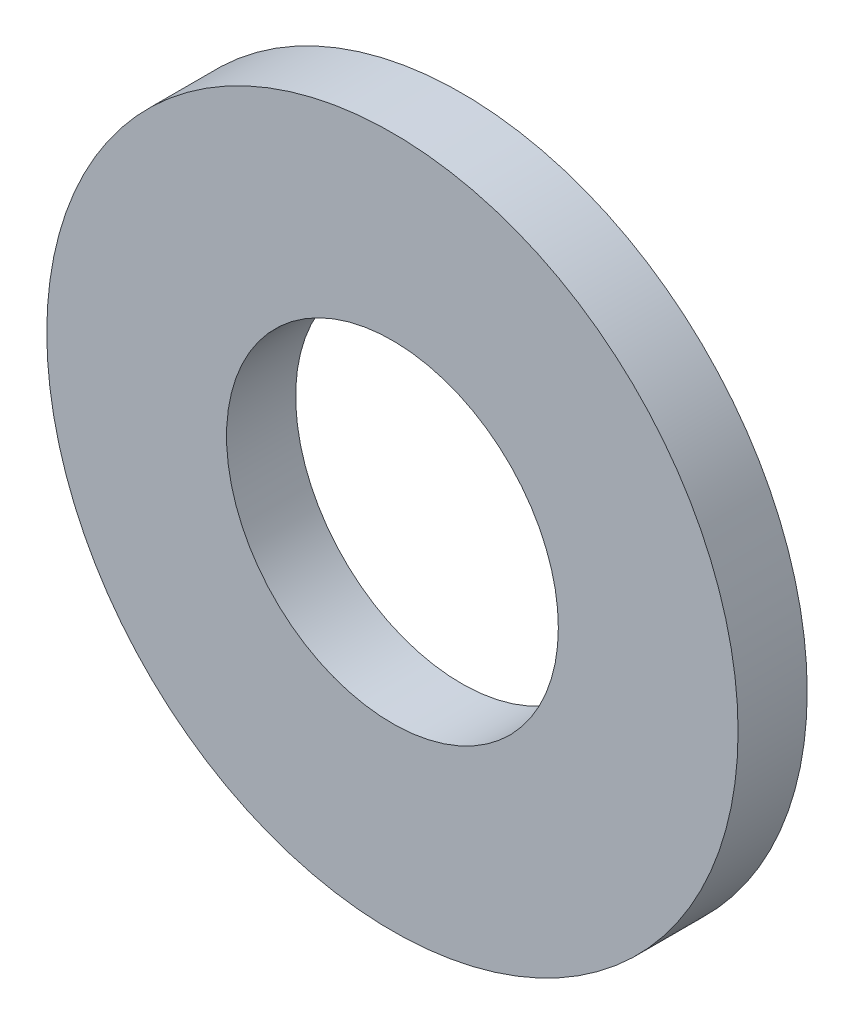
ISO-10303-21;
HEADER;
FILE_DESCRIPTION(('STEP AP214'),'2;1');
FILE_NAME('part.step','',(''),(''),'','','');
FILE_SCHEMA(('AUTOMOTIVE_DESIGN { 1 0 10303 214 1 1 1 1 }'));
ENDSEC;
DATA;
#1=APPLICATION_CONTEXT('core data for automotive mechanical design processes');
#2=APPLICATION_PROTOCOL_DEFINITION('international standard','automotive_design',2000,#1);
#3=PRODUCT_CONTEXT('',#1,'mechanical');
#4=PRODUCT('Part','Part','',(#3));
#5=PRODUCT_RELATED_PRODUCT_CATEGORY('part','',(#4));
#6=PRODUCT_DEFINITION_FORMATION('','',#4);
#7=PRODUCT_DEFINITION_CONTEXT('part definition',#1,'design');
#8=PRODUCT_DEFINITION('design','',#6,#7);
#9=PRODUCT_DEFINITION_SHAPE('','',#8);
#10=(LENGTH_UNIT() NAMED_UNIT(*) SI_UNIT(.MILLI.,.METRE.));
#11=(NAMED_UNIT(*) PLANE_ANGLE_UNIT() SI_UNIT($,.RADIAN.));
#12=(NAMED_UNIT(*) SI_UNIT($,.STERADIAN.) SOLID_ANGLE_UNIT());
#13=UNCERTAINTY_MEASURE_WITH_UNIT(LENGTH_MEASURE(1.E-05),#10,'distance_accuracy_value','');
#14=(GEOMETRIC_REPRESENTATION_CONTEXT(3) GLOBAL_UNCERTAINTY_ASSIGNED_CONTEXT((#13)) GLOBAL_UNIT_ASSIGNED_CONTEXT((#10,
#11,#12)) REPRESENTATION_CONTEXT('',''));
#15=CARTESIAN_POINT('',(0.,0.,0.));
#16=DIRECTION('',(0.,0.,1.));
#17=DIRECTION('',(1.,0.,0.));
#18=AXIS2_PLACEMENT_3D('',#15,#16,#17);
#19=CARTESIAN_POINT('',(0.,0.,2.5));
#20=DIRECTION('',(0.,0.,1.));
#21=DIRECTION('',(1.,0.,0.));
#22=AXIS2_PLACEMENT_3D('',#19,#20,#21);
#23=PLANE('',#22);
#24=CARTESIAN_POINT('',(0.,0.,2.5));
#25=DIRECTION('',(0.,0.,1.));
#26=DIRECTION('',(1.,0.,0.));
#27=AXIS2_PLACEMENT_3D('',#24,#25,#26);
#28=CIRCLE('',#27,12.5);
#29=CARTESIAN_POINT('',(12.5,0.,2.5));
#30=VERTEX_POINT('',#29);
#31=EDGE_CURVE('E10',#30,#30,#28,.T.);
#32=ORIENTED_EDGE('',*,*,#31,.T.);
#33=EDGE_LOOP('',(#32));
#34=FACE_BOUND('',#33,.T.);
#35=CARTESIAN_POINT('',(0.,0.,2.5));
#36=DIRECTION('',(0.,0.,1.));
#37=DIRECTION('',(1.,0.,0.));
#38=AXIS2_PLACEMENT_3D('',#35,#36,#37);
#39=CIRCLE('',#38,6.);
#40=CARTESIAN_POINT('',(6.,0.,2.5));
#41=VERTEX_POINT('',#40);
#42=EDGE_CURVE('E40',#41,#41,#39,.T.);
#43=ORIENTED_EDGE('',*,*,#42,.F.);
#44=EDGE_LOOP('',(#43));
#45=FACE_BOUND('',#44,.T.);
#46=ADVANCED_FACE('F29',(#34,#45),#23,.T.);
#47=CARTESIAN_POINT('',(0.,0.,0.));
#48=DIRECTION('',(0.,0.,1.));
#49=DIRECTION('',(1.,0.,0.));
#50=AXIS2_PLACEMENT_3D('',#47,#48,#49);
#51=PLANE('',#50);
#52=CARTESIAN_POINT('',(0.,0.,0.));
#53=DIRECTION('',(0.,0.,1.));
#54=DIRECTION('',(1.,0.,0.));
#55=AXIS2_PLACEMENT_3D('',#52,#53,#54);
#56=CIRCLE('',#55,12.5);
#57=CARTESIAN_POINT('',(12.5,0.,0.));
#58=VERTEX_POINT('',#57);
#59=EDGE_CURVE('E33',#58,#58,#56,.T.);
#60=ORIENTED_EDGE('',*,*,#59,.F.);
#61=EDGE_LOOP('',(#60));
#62=FACE_BOUND('',#61,.T.);
#63=CARTESIAN_POINT('',(0.,0.,0.));
#64=DIRECTION('',(0.,0.,1.));
#65=DIRECTION('',(1.,0.,0.));
#66=AXIS2_PLACEMENT_3D('',#63,#64,#65);
#67=CIRCLE('',#66,6.);
#68=CARTESIAN_POINT('',(6.,0.,0.));
#69=VERTEX_POINT('',#68);
#70=EDGE_CURVE('E42',#69,#69,#67,.T.);
#71=ORIENTED_EDGE('',*,*,#70,.T.);
#72=EDGE_LOOP('',(#71));
#73=FACE_BOUND('',#72,.T.);
#74=ADVANCED_FACE('F52',(#62,#73),#51,.F.);
#75=CARTESIAN_POINT('',(0.,0.,2.5));
#76=DIRECTION('',(0.,0.,-1.));
#77=DIRECTION('',(-1.,0.,0.));
#78=AXIS2_PLACEMENT_3D('',#75,#76,#77);
#79=CYLINDRICAL_SURFACE('',#78,12.5);
#80=ORIENTED_EDGE('',*,*,#31,.F.);
#81=EDGE_LOOP('',(#80));
#82=FACE_BOUND('',#81,.T.);
#83=ORIENTED_EDGE('',*,*,#59,.T.);
#84=EDGE_LOOP('',(#83));
#85=FACE_BOUND('',#84,.T.);
#86=ADVANCED_FACE('F31',(#82,#85),#79,.T.);
#87=CARTESIAN_POINT('',(0.,0.,2.5));
#88=DIRECTION('',(0.,0.,-1.));
#89=DIRECTION('',(-1.,0.,0.));
#90=AXIS2_PLACEMENT_3D('',#87,#88,#89);
#91=CYLINDRICAL_SURFACE('',#90,6.);
#92=ORIENTED_EDGE('',*,*,#42,.T.);
#93=EDGE_LOOP('',(#92));
#94=FACE_BOUND('',#93,.T.);
#95=ORIENTED_EDGE('',*,*,#70,.F.);
#96=EDGE_LOOP('',(#95));
#97=FACE_BOUND('',#96,.T.);
#98=ADVANCED_FACE('F48',(#94,#97),#91,.F.);
#99=CLOSED_SHELL('',(#46,#74,#86,#98));
#100=MANIFOLD_SOLID_BREP('B2',#99);
#101=ADVANCED_BREP_SHAPE_REPRESENTATION('',(#18,#100),#14);
#102=SHAPE_DEFINITION_REPRESENTATION(#9,#101);
ENDSEC;
END-ISO-10303-21;
